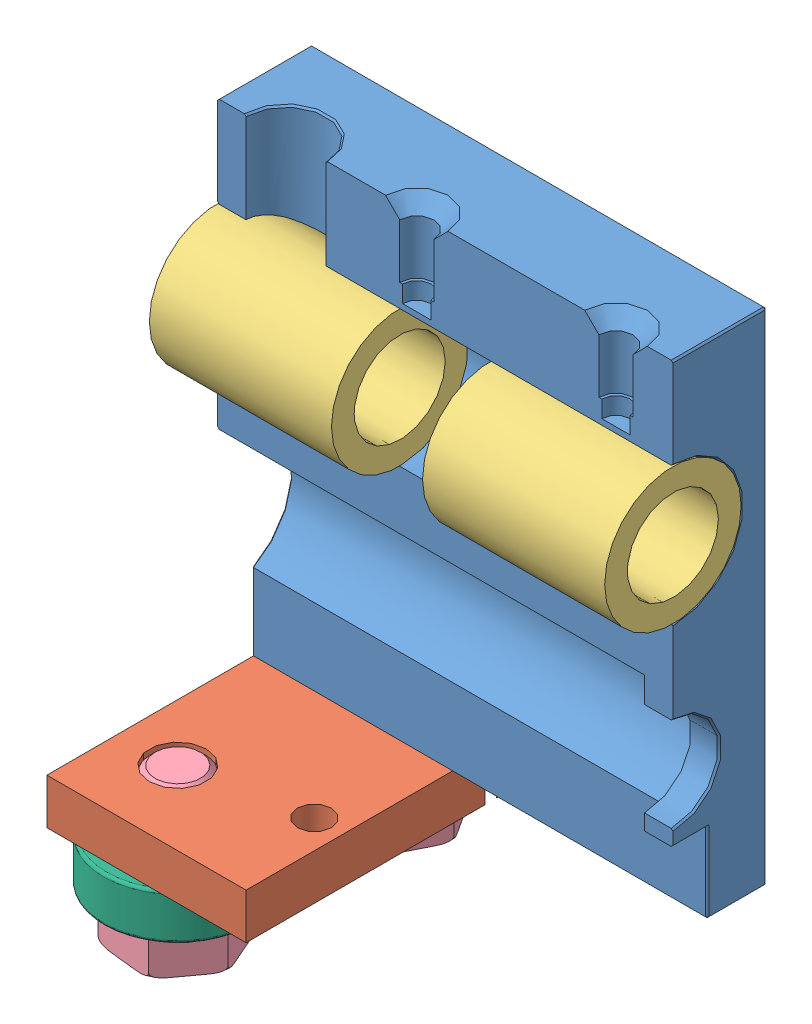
SolidWorks assembly ensemble_chariot1.SLDASM, configuration Défaut (file format 4400). Lengths in mm.
Overall size (89.47 114.26 76.95).
14 component instances, 6 part files, 10 mates.
Components (placement in the parent):
- chariot1-1: chariot1.SLDPRT [Défaut] at (-16.5683 -70.7141 -17.5) size (80 88 16.98)
- plaque_chariot-1: plaque_chariot.SLDPRT [Défaut] at (-46.5683 -122.7141 -1) x (0 0 1) z (0 1 0) size (60 35 8)
- douilles_a_billes-1: douilles_a_billes.SLDPRT [Défaut] at (-24.5683 -54.7141 -1) x (0 0 1) z (-1 0 0) size (24 24 32)
- douilles_a_billes-2: douilles_a_billes.SLDPRT [Défaut] at (23.4317 -54.7141 -1) x (0 0 1) z (-1 0 0) size (24 24 32)
- ensemble_galet1-1: ensemble_galet1.SLDASM [Défaut] at (-187.1418 -135.6824 77.8602) x (-0.915296 0 0.402781) z (0.402781 0 0.915296) size (35.81 26.26 35.81)
  - Charvis31-1: Charvis31.SLDPRT [Défaut] at (-153.5825 -0.9683 0) size (17.84 26.26 20.51)
  - Charron11-1: Charron11.SLDPRT [Défaut] at (-153.5825 -2.9683 0) size (20 2 20)
  - Charron11-2: Charron11.SLDPRT [Défaut] at (-153.5825 -12.9683 0) x (0.997615 0 -0.069022) z (0.069022 0 0.997615) size (20 2 20)
  - roulement-1: roulement.SLDPRT [Défaut] at (-153.5825 -6.9683 0) x (0 1 0) z (0.849439 0 0.527686) size (8 26 26)
- ensemble_galet1-2: ensemble_galet1.SLDASM [Défaut] at (-175.1428 -135.6824 62.001) x (-0.837169 0 0.546944) z (0.546944 0 0.837169) size (35.81 26.26 35.81)
  - Charvis31-1: Charvis31.SLDPRT [Défaut] at (-153.5825 -0.9683 0) size (17.84 26.26 20.51)
  - Charron11-1: Charron11.SLDPRT [Défaut] at (-153.5825 -2.9683 0) size (20 2 20)
  - Charron11-2: Charron11.SLDPRT [Défaut] at (-153.5825 -12.9683 0) x (0.997615 0 -0.069022) z (0.069022 0 0.997615) size (20 2 20)
  - roulement-1: roulement.SLDPRT [Défaut] at (-153.5825 -6.9683 0) x (0 1 0) z (0.849439 0 0.527686) size (8 26 26)
Mates (geometry in assembly coordinates):
- Concentrique1: concentric anti-aligned: cylinder of chariot1-1 through (88.4317 -54.7141 -1) axis (-1 0 0) radius 12; cylinder of douilles_a_billes-1 through (-56.5683 -54.7141 -1) axis (1 0 0) radius 12
- Coïncidente1: coincident aligned: plane of chariot1-1 through (-56.5683 -26.7141 17.5) normal (-1 0 0); plane of douilles_a_billes-1 through (-56.5683 -54.7141 -1) normal (-1 0 0)
- Concentrique2: concentric anti-aligned: cylinder of chariot1-1 through (88.4317 -54.7141 -1) axis (-1 0 0) radius 12; cylinder of douilles_a_billes-2 through (-8.5683 -54.7141 -1) axis (1 0 0) radius 12
- Coïncidente2: coincident aligned: plane of chariot1-1 through (23.4317 -114.7141 17.5) normal (1 0 0); plane of douilles_a_billes-2 through (23.4317 -54.7141 -1) normal (1 0 0)
- Coïncidente3: coincident anti-aligned: plane of chariot1-1 through (23.4317 -114.7141 17.5) normal (0 -1 0); plane of plaque_chariot-1 through (-21.5683 -114.7141 -31) normal (0 1 0)
- Concentrique3: concentric anti-aligned: cylinder of chariot1-1 through (-26.5683 -104.7141 -14) axis (0 -1 0) radius 3; cylinder of plaque_chariot-1 through (-26.5683 -122.7141 -14) axis (0 1 0) radius 3.05
- Coïncidente11: coincident anti-aligned: plane of plaque_chariot-1 through (-21.5683 -122.7141 -31) normal (0 -1 0); plane of ensemble_galet1-1/Charron11-2 through (-46.5683 -122.7141 16) normal (0 1 0)
- Concentrique8: concentric anti-aligned: cylinder of plaque_chariot-1 through (-46.5683 -122.7141 16) axis (0 1 0) radius 5; cylinder of ensemble_galet1-1/Charvis31-1 through (-46.5683 -114.7141 16) axis (0 -1 0) radius 5
- Coïncidente12: coincident anti-aligned: plane of plaque_chariot-1 through (-21.5683 -122.7141 -31) normal (0 -1 0); plane of ensemble_galet1-2/Charron11-2 through (-46.5683 -122.7141 -22) normal (0 1 0)
- Concentrique9: concentric anti-aligned: cylinder of plaque_chariot-1 through (-46.5683 -122.7141 -22) axis (0 1 0) radius 5; cylinder of ensemble_galet1-2/Charvis31-1 through (-46.5683 -114.7141 -22) axis (0 -1 0) radius 5
